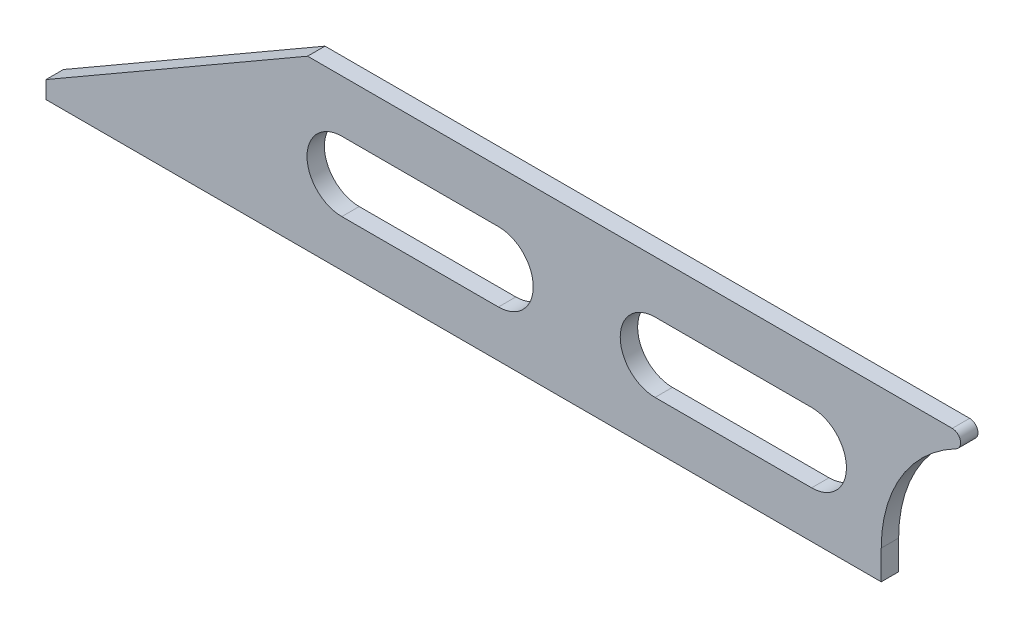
from build123d import *

# Parameters (mm, degrees)
EXTRUDE1_DEPTH     = 3.175
CUT_EXTRUDE1_DEPTH = 6.35
LPATTERN1_COUNT    = 2
LPATTERN1_PITCH    = 114.3
EXTRUDE2_START     = -6.35
EXTRUDE2_DEPTH     = 6.35
FILLET1_R          = 3.048


with BuildPart() as part:
    # Sketch1 → Extrude1 (new, symmetric)
    with BuildSketch(Plane.XY):
        Polygon((0, 0), (0, 6.35), (95.467176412, 61.468), (304.8, 61.468), (304.8, 0), align=None)
    extrude(amount=EXTRUDE1_DEPTH, both=True)

    # Sketch3 → Cut-Extrude1 (cut)
    with BuildSketch(Plane.XY.offset(3.175)):
        with BuildLine():
            Line((279.4, 42.418), (222.25, 42.418))
            ThreePointArc((222.25, 42.418), (209.55, 29.718), (222.25, 17.018))
            Line((222.25, 17.018), (279.4, 17.018))
            ThreePointArc((279.4, 17.018), (292.1, 29.718), (279.4, 42.418))
        make_face()
    cut_extrude1 = extrude(amount=-CUT_EXTRUDE1_DEPTH, mode=Mode.SUBTRACT)

    # LPattern1: Cut-Extrude1 ×2
    with Locations(*[(-i * LPATTERN1_PITCH, 0, 0) for i in range(1, LPATTERN1_COUNT)]):
        add(cut_extrude1, mode=Mode.SUBTRACT)

    # Sketch4 → Extrude2 (add)
    with BuildSketch(Plane.XY.offset(3.175).offset(EXTRUDE2_START)):
        with BuildLine():
            Line((304.8, 61.468), (355.6, 61.468))
            ThreePointArc((355.6, 61.468), (319.678975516, 46.589024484), (304.8, 10.668))
            Line((304.8, 10.668), (304.8, 61.468))
        make_face()
    extrude(amount=EXTRUDE2_DEPTH)

    # Fillet1
    fillet1_edges = [part.edges().sort_by_distance(p)[0] for p in [
        (355.6, 61.468, 0),
    ]]
    fillet(fillet1_edges, radius=FILLET1_R)


solid = part.part
